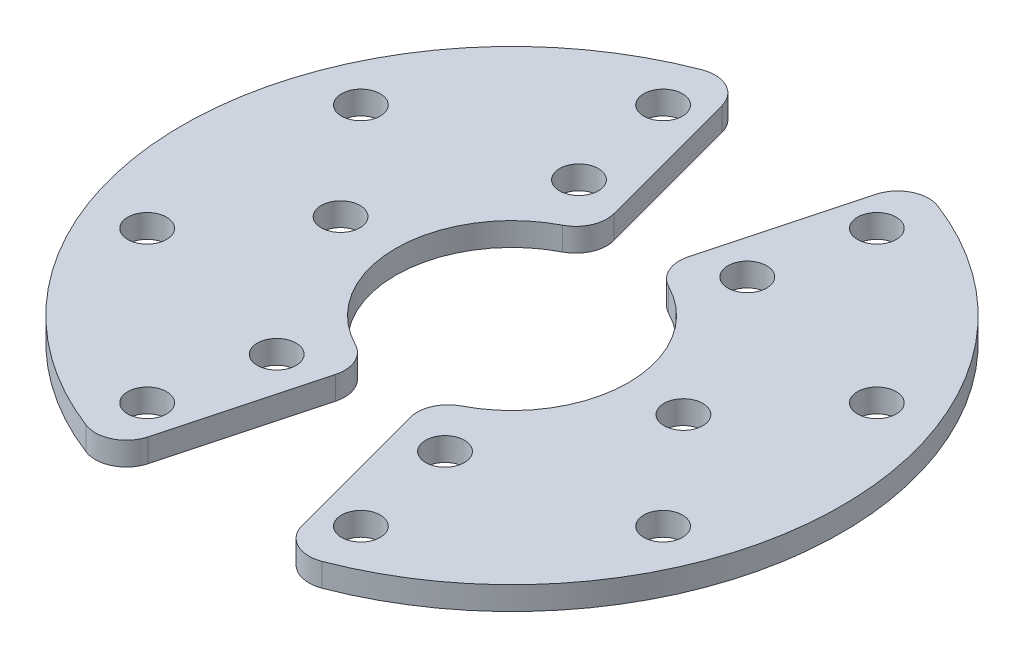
ISO-10303-21;
HEADER;
FILE_DESCRIPTION(('STEP AP214'),'2;1');
FILE_NAME('part.step','',(''),(''),'','','');
FILE_SCHEMA(('AUTOMOTIVE_DESIGN { 1 0 10303 214 1 1 1 1 }'));
ENDSEC;
DATA;
#1=APPLICATION_CONTEXT('core data for automotive mechanical design processes');
#2=APPLICATION_PROTOCOL_DEFINITION('international standard','automotive_design',2000,#1);
#3=PRODUCT_CONTEXT('',#1,'mechanical');
#4=PRODUCT('Part','Part','',(#3));
#5=PRODUCT_RELATED_PRODUCT_CATEGORY('part','',(#4));
#6=PRODUCT_DEFINITION_FORMATION('','',#4);
#7=PRODUCT_DEFINITION_CONTEXT('part definition',#1,'design');
#8=PRODUCT_DEFINITION('design','',#6,#7);
#9=PRODUCT_DEFINITION_SHAPE('','',#8);
#10=(LENGTH_UNIT() NAMED_UNIT(*) SI_UNIT(.MILLI.,.METRE.));
#11=(NAMED_UNIT(*) PLANE_ANGLE_UNIT() SI_UNIT($,.RADIAN.));
#12=(NAMED_UNIT(*) SI_UNIT($,.STERADIAN.) SOLID_ANGLE_UNIT());
#13=UNCERTAINTY_MEASURE_WITH_UNIT(LENGTH_MEASURE(1.E-05),#10,'distance_accuracy_value','');
#14=(GEOMETRIC_REPRESENTATION_CONTEXT(3) GLOBAL_UNCERTAINTY_ASSIGNED_CONTEXT((#13)) GLOBAL_UNIT_ASSIGNED_CONTEXT((#10,
#11,#12)) REPRESENTATION_CONTEXT('',''));
#15=CARTESIAN_POINT('',(0.,0.,0.));
#16=DIRECTION('',(0.,0.,1.));
#17=DIRECTION('',(1.,0.,0.));
#18=AXIS2_PLACEMENT_3D('',#15,#16,#17);
#19=CARTESIAN_POINT('',(0.,3.,0.));
#20=DIRECTION('',(0.,-1.,0.));
#21=DIRECTION('',(0.,0.,-1.));
#22=AXIS2_PLACEMENT_3D('',#19,#20,#21);
#23=CYLINDRICAL_SURFACE('',#22,15.);
#24=CARTESIAN_POINT('',(0.,3.,0.));
#25=DIRECTION('',(0.,1.,0.));
#26=DIRECTION('',(0.,0.,1.));
#27=AXIS2_PLACEMENT_3D('',#24,#25,#26);
#28=CIRCLE('',#27,15.);
#29=CARTESIAN_POINT('',(-6.84556871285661,3.,-13.3468419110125));
#30=VERTEX_POINT('',#29);
#31=CARTESIAN_POINT('',(-6.84556871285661,3.,13.3468419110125));
#32=VERTEX_POINT('',#31);
#33=EDGE_CURVE('E223',#30,#32,#28,.T.);
#34=ORIENTED_EDGE('',*,*,#33,.T.);
#35=DIRECTION('',(0.,-1.,0.));
#36=VECTOR('',#35,1.);
#37=CARTESIAN_POINT('',(-6.84556871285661,3.,13.3468419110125));
#38=LINE('',#37,#36);
#39=CARTESIAN_POINT('',(-6.84556871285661,0.,13.3468419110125));
#40=VERTEX_POINT('',#39);
#41=EDGE_CURVE('E165',#32,#40,#38,.T.);
#42=ORIENTED_EDGE('',*,*,#41,.T.);
#43=CARTESIAN_POINT('',(0.,0.,0.));
#44=DIRECTION('',(0.,1.,0.));
#45=DIRECTION('',(0.,0.,1.));
#46=AXIS2_PLACEMENT_3D('',#43,#44,#45);
#47=CIRCLE('',#46,15.);
#48=CARTESIAN_POINT('',(-6.84556871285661,0.,-13.3468419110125));
#49=VERTEX_POINT('',#48);
#50=EDGE_CURVE('E147',#49,#40,#47,.T.);
#51=ORIENTED_EDGE('',*,*,#50,.F.);
#52=DIRECTION('',(0.,-1.,0.));
#53=VECTOR('',#52,1.);
#54=CARTESIAN_POINT('',(-6.84556871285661,3.,-13.3468419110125));
#55=LINE('',#54,#53);
#56=EDGE_CURVE('E163',#49,#30,#55,.F.);
#57=ORIENTED_EDGE('',*,*,#56,.T.);
#58=EDGE_LOOP('',(#34,#42,#51,#57));
#59=FACE_BOUND('',#58,.T.);
#60=ADVANCED_FACE('F48',(#59),#23,.F.);
#61=CARTESIAN_POINT('',(0.,3.,0.));
#62=DIRECTION('',(0.,-1.,0.));
#63=DIRECTION('',(0.,0.,-1.));
#64=AXIS2_PLACEMENT_3D('',#61,#62,#63);
#65=CYLINDRICAL_SURFACE('',#64,42.5);
#66=CARTESIAN_POINT('',(0.,0.,0.));
#67=DIRECTION('',(0.,1.,0.));
#68=DIRECTION('',(0.,0.,1.));
#69=AXIS2_PLACEMENT_3D('',#66,#67,#68);
#70=CIRCLE('',#69,42.5);
#71=CARTESIAN_POINT('',(-15.2054071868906,0.,-39.6868440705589));
#72=VERTEX_POINT('',#71);
#73=CARTESIAN_POINT('',(-15.2054071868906,0.,39.6868440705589));
#74=VERTEX_POINT('',#73);
#75=EDGE_CURVE('E136',#72,#74,#70,.T.);
#76=ORIENTED_EDGE('',*,*,#75,.T.);
#77=DIRECTION('',(0.,-1.,0.));
#78=VECTOR('',#77,1.);
#79=CARTESIAN_POINT('',(-15.2054071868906,3.,39.6868440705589));
#80=LINE('',#79,#78);
#81=CARTESIAN_POINT('',(-15.2054071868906,3.,39.6868440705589));
#82=VERTEX_POINT('',#81);
#83=EDGE_CURVE('E134',#74,#82,#80,.F.);
#84=ORIENTED_EDGE('',*,*,#83,.T.);
#85=CARTESIAN_POINT('',(0.,3.,0.));
#86=DIRECTION('',(0.,1.,0.));
#87=DIRECTION('',(0.,0.,1.));
#88=AXIS2_PLACEMENT_3D('',#85,#86,#87);
#89=CIRCLE('',#88,42.5);
#90=CARTESIAN_POINT('',(-15.2054071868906,3.,-39.6868440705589));
#91=VERTEX_POINT('',#90);
#92=EDGE_CURVE('E118',#91,#82,#89,.T.);
#93=ORIENTED_EDGE('',*,*,#92,.F.);
#94=DIRECTION('',(0.,-1.,0.));
#95=VECTOR('',#94,1.);
#96=CARTESIAN_POINT('',(-15.2054071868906,3.,-39.6868440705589));
#97=LINE('',#96,#95);
#98=EDGE_CURVE('E131',#91,#72,#97,.T.);
#99=ORIENTED_EDGE('',*,*,#98,.T.);
#100=EDGE_LOOP('',(#76,#84,#93,#99));
#101=FACE_BOUND('',#100,.T.);
#102=ADVANCED_FACE('F130',(#101),#65,.T.);
#103=CARTESIAN_POINT('',(0.,3.,0.));
#104=DIRECTION('',(0.,1.,0.));
#105=DIRECTION('',(0.,0.,1.));
#106=AXIS2_PLACEMENT_3D('',#103,#104,#105);
#107=PLANE('',#106);
#108=CARTESIAN_POINT('',(-10.85,3.,19.4855715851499));
#109=DIRECTION('',(0.,1.,0.));
#110=DIRECTION('',(0.,0.,1.));
#111=AXIS2_PLACEMENT_3D('',#108,#109,#110);
#112=CIRCLE('',#111,2.5);
#113=CARTESIAN_POINT('',(-10.85,3.,21.9855715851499));
#114=VERTEX_POINT('',#113);
#115=EDGE_CURVE('E217',#114,#114,#112,.T.);
#116=ORIENTED_EDGE('',*,*,#115,.F.);
#117=EDGE_LOOP('',(#116));
#118=FACE_BOUND('',#117,.T.);
#119=CARTESIAN_POINT('',(-22.1,3.,0.));
#120=DIRECTION('',(0.,1.,0.));
#121=DIRECTION('',(0.,0.,1.));
#122=AXIS2_PLACEMENT_3D('',#119,#120,#121);
#123=CIRCLE('',#122,2.49999999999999);
#124=CARTESIAN_POINT('',(-22.1,3.,2.49999999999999));
#125=VERTEX_POINT('',#124);
#126=EDGE_CURVE('E214',#125,#125,#123,.T.);
#127=ORIENTED_EDGE('',*,*,#126,.F.);
#128=EDGE_LOOP('',(#127));
#129=FACE_BOUND('',#128,.T.);
#130=CARTESIAN_POINT('',(-10.85,3.,-19.4855715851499));
#131=DIRECTION('',(0.,1.,0.));
#132=DIRECTION('',(0.,0.,1.));
#133=AXIS2_PLACEMENT_3D('',#130,#131,#132);
#134=CIRCLE('',#133,2.50000000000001);
#135=CARTESIAN_POINT('',(-10.85,3.,-16.9855715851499));
#136=VERTEX_POINT('',#135);
#137=EDGE_CURVE('E211',#136,#136,#134,.T.);
#138=ORIENTED_EDGE('',*,*,#137,.F.);
#139=EDGE_LOOP('',(#138));
#140=FACE_BOUND('',#139,.T.);
#141=CARTESIAN_POINT('',(-13.776603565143,3.,-33.2596631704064));
#142=DIRECTION('',(0.,1.,0.));
#143=DIRECTION('',(0.,0.,1.));
#144=AXIS2_PLACEMENT_3D('',#141,#142,#143);
#145=CIRCLE('',#144,2.50000000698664);
#146=CARTESIAN_POINT('',(-13.776603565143,3.,-30.7596631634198));
#147=VERTEX_POINT('',#146);
#148=EDGE_CURVE('E208',#147,#147,#145,.T.);
#149=ORIENTED_EDGE('',*,*,#148,.F.);
#150=EDGE_LOOP('',(#149));
#151=FACE_BOUND('',#150,.T.);
#152=CARTESIAN_POINT('',(-33.2596631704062,3.,-13.7766035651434));
#153=DIRECTION('',(0.,1.,0.));
#154=DIRECTION('',(0.,0.,1.));
#155=AXIS2_PLACEMENT_3D('',#152,#153,#154);
#156=CIRCLE('',#155,2.5);
#157=CARTESIAN_POINT('',(-33.2596631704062,3.,-11.2766035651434));
#158=VERTEX_POINT('',#157);
#159=EDGE_CURVE('E205',#158,#158,#156,.T.);
#160=ORIENTED_EDGE('',*,*,#159,.F.);
#161=EDGE_LOOP('',(#160));
#162=FACE_BOUND('',#161,.T.);
#163=CARTESIAN_POINT('',(-33.2596631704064,3.,13.776603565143));
#164=DIRECTION('',(0.,1.,0.));
#165=DIRECTION('',(0.,0.,1.));
#166=AXIS2_PLACEMENT_3D('',#163,#164,#165);
#167=CIRCLE('',#166,2.5);
#168=CARTESIAN_POINT('',(-33.2596631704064,3.,16.276603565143));
#169=VERTEX_POINT('',#168);
#170=EDGE_CURVE('E202',#169,#169,#167,.T.);
#171=ORIENTED_EDGE('',*,*,#170,.F.);
#172=EDGE_LOOP('',(#171));
#173=FACE_BOUND('',#172,.T.);
#174=CARTESIAN_POINT('',(-13.7766035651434,3.,33.2596631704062));
#175=DIRECTION('',(0.,1.,0.));
#176=DIRECTION('',(0.,0.,1.));
#177=AXIS2_PLACEMENT_3D('',#174,#175,#176);
#178=CIRCLE('',#177,2.5);
#179=CARTESIAN_POINT('',(-13.7766035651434,3.,35.7596631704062));
#180=VERTEX_POINT('',#179);
#181=EDGE_CURVE('E178',#180,#180,#178,.T.);
#182=ORIENTED_EDGE('',*,*,#181,.F.);
#183=EDGE_LOOP('',(#182));
#184=FACE_BOUND('',#183,.T.);
#185=ORIENTED_EDGE('',*,*,#92,.T.);
#186=CARTESIAN_POINT('',(-13.7743100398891,3.,35.9516116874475));
#187=DIRECTION('',(0.,1.,0.));
#188=DIRECTION('',(0.,0.,1.));
#189=AXIS2_PLACEMENT_3D('',#186,#187,#188);
#190=CIRCLE('',#189,4.);
#191=CARTESIAN_POINT('',(-9.91060673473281,3.,36.9868878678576));
#192=VERTEX_POINT('',#191);
#193=EDGE_CURVE('E152',#82,#192,#190,.T.);
#194=ORIENTED_EDGE('',*,*,#193,.T.);
#195=DIRECTION('',(0.258819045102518,0.,-0.965925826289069));
#196=VECTOR('',#195,1.);
#197=CARTESIAN_POINT('',(0.,3.,0.));
#198=LINE('',#197,#196);
#199=CARTESIAN_POINT('',(-4.80735039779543,3.,17.9412759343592));
#200=VERTEX_POINT('',#199);
#201=EDGE_CURVE('E135',#192,#200,#198,.T.);
#202=ORIENTED_EDGE('',*,*,#201,.T.);
#203=CARTESIAN_POINT('',(-8.6710537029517,3.,16.9059997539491));
#204=DIRECTION('',(0.,1.,0.));
#205=DIRECTION('',(0.,0.,1.));
#206=AXIS2_PLACEMENT_3D('',#203,#204,#205);
#207=CIRCLE('',#206,4.);
#208=EDGE_CURVE('E124',#200,#32,#207,.T.);
#209=ORIENTED_EDGE('',*,*,#208,.T.);
#210=ORIENTED_EDGE('',*,*,#33,.F.);
#211=CARTESIAN_POINT('',(-8.6710537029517,3.,-16.9059997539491));
#212=DIRECTION('',(0.,1.,0.));
#213=DIRECTION('',(0.,0.,1.));
#214=AXIS2_PLACEMENT_3D('',#211,#212,#213);
#215=CIRCLE('',#214,4.);
#216=CARTESIAN_POINT('',(-4.80735039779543,3.,-17.9412759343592));
#217=VERTEX_POINT('',#216);
#218=EDGE_CURVE('E125',#30,#217,#215,.T.);
#219=ORIENTED_EDGE('',*,*,#218,.T.);
#220=DIRECTION('',(0.258819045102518,0.,0.965925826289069));
#221=VECTOR('',#220,1.);
#222=CARTESIAN_POINT('',(0.,3.,0.));
#223=LINE('',#222,#221);
#224=CARTESIAN_POINT('',(-9.91060673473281,3.,-36.9868878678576));
#225=VERTEX_POINT('',#224);
#226=EDGE_CURVE('E120',#225,#217,#223,.T.);
#227=ORIENTED_EDGE('',*,*,#226,.F.);
#228=CARTESIAN_POINT('',(-13.7743100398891,3.,-35.9516116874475));
#229=DIRECTION('',(0.,1.,0.));
#230=DIRECTION('',(0.,0.,1.));
#231=AXIS2_PLACEMENT_3D('',#228,#229,#230);
#232=CIRCLE('',#231,4.);
#233=EDGE_CURVE('E115',#225,#91,#232,.T.);
#234=ORIENTED_EDGE('',*,*,#233,.T.);
#235=EDGE_LOOP('',(#185,#194,#202,#209,#210,#219,#227,#234));
#236=FACE_BOUND('',#235,.T.);
#237=ADVANCED_FACE('F117',(#118,#129,#140,#151,#162,#173,#184,#236),#107,.T.);
#238=CARTESIAN_POINT('',(0.,0.,0.));
#239=DIRECTION('',(0.,1.,0.));
#240=DIRECTION('',(0.,0.,1.));
#241=AXIS2_PLACEMENT_3D('',#238,#239,#240);
#242=PLANE('',#241);
#243=CARTESIAN_POINT('',(-13.7766035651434,0.,33.2596631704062));
#244=DIRECTION('',(0.,1.,0.));
#245=DIRECTION('',(0.,0.,1.));
#246=AXIS2_PLACEMENT_3D('',#243,#244,#245);
#247=CIRCLE('',#246,2.5);
#248=CARTESIAN_POINT('',(-13.7766035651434,0.,35.7596631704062));
#249=VERTEX_POINT('',#248);
#250=EDGE_CURVE('E183',#249,#249,#247,.T.);
#251=ORIENTED_EDGE('',*,*,#250,.T.);
#252=EDGE_LOOP('',(#251));
#253=FACE_BOUND('',#252,.T.);
#254=CARTESIAN_POINT('',(-33.2596631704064,0.,13.776603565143));
#255=DIRECTION('',(0.,1.,0.));
#256=DIRECTION('',(0.,0.,1.));
#257=AXIS2_PLACEMENT_3D('',#254,#255,#256);
#258=CIRCLE('',#257,2.5);
#259=CARTESIAN_POINT('',(-33.2596631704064,0.,16.276603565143));
#260=VERTEX_POINT('',#259);
#261=EDGE_CURVE('E186',#260,#260,#258,.T.);
#262=ORIENTED_EDGE('',*,*,#261,.T.);
#263=EDGE_LOOP('',(#262));
#264=FACE_BOUND('',#263,.T.);
#265=CARTESIAN_POINT('',(-33.2596631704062,0.,-13.7766035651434));
#266=DIRECTION('',(0.,1.,0.));
#267=DIRECTION('',(0.,0.,1.));
#268=AXIS2_PLACEMENT_3D('',#265,#266,#267);
#269=CIRCLE('',#268,2.5);
#270=CARTESIAN_POINT('',(-33.2596631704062,0.,-11.2766035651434));
#271=VERTEX_POINT('',#270);
#272=EDGE_CURVE('E189',#271,#271,#269,.T.);
#273=ORIENTED_EDGE('',*,*,#272,.T.);
#274=EDGE_LOOP('',(#273));
#275=FACE_BOUND('',#274,.T.);
#276=CARTESIAN_POINT('',(-13.776603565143,0.,-33.2596631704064));
#277=DIRECTION('',(0.,1.,0.));
#278=DIRECTION('',(0.,0.,1.));
#279=AXIS2_PLACEMENT_3D('',#276,#277,#278);
#280=CIRCLE('',#279,2.50000000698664);
#281=CARTESIAN_POINT('',(-13.776603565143,0.,-30.7596631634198));
#282=VERTEX_POINT('',#281);
#283=EDGE_CURVE('E192',#282,#282,#280,.T.);
#284=ORIENTED_EDGE('',*,*,#283,.T.);
#285=EDGE_LOOP('',(#284));
#286=FACE_BOUND('',#285,.T.);
#287=CARTESIAN_POINT('',(-10.85,0.,-19.4855715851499));
#288=DIRECTION('',(0.,1.,0.));
#289=DIRECTION('',(0.,0.,1.));
#290=AXIS2_PLACEMENT_3D('',#287,#288,#289);
#291=CIRCLE('',#290,2.50000000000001);
#292=CARTESIAN_POINT('',(-10.85,0.,-16.9855715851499));
#293=VERTEX_POINT('',#292);
#294=EDGE_CURVE('E195',#293,#293,#291,.T.);
#295=ORIENTED_EDGE('',*,*,#294,.T.);
#296=EDGE_LOOP('',(#295));
#297=FACE_BOUND('',#296,.T.);
#298=CARTESIAN_POINT('',(-22.1,0.,0.));
#299=DIRECTION('',(0.,1.,0.));
#300=DIRECTION('',(0.,0.,1.));
#301=AXIS2_PLACEMENT_3D('',#298,#299,#300);
#302=CIRCLE('',#301,2.49999999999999);
#303=CARTESIAN_POINT('',(-22.1,0.,2.49999999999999));
#304=VERTEX_POINT('',#303);
#305=EDGE_CURVE('E180',#304,#304,#302,.T.);
#306=ORIENTED_EDGE('',*,*,#305,.T.);
#307=EDGE_LOOP('',(#306));
#308=FACE_BOUND('',#307,.T.);
#309=CARTESIAN_POINT('',(-10.85,0.,19.4855715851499));
#310=DIRECTION('',(0.,1.,0.));
#311=DIRECTION('',(0.,0.,1.));
#312=AXIS2_PLACEMENT_3D('',#309,#310,#311);
#313=CIRCLE('',#312,2.5);
#314=CARTESIAN_POINT('',(-10.85,0.,21.9855715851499));
#315=VERTEX_POINT('',#314);
#316=EDGE_CURVE('E176',#315,#315,#313,.T.);
#317=ORIENTED_EDGE('',*,*,#316,.T.);
#318=EDGE_LOOP('',(#317));
#319=FACE_BOUND('',#318,.T.);
#320=DIRECTION('',(0.258819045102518,0.,-0.965925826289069));
#321=VECTOR('',#320,1.);
#322=CARTESIAN_POINT('',(0.,0.,0.));
#323=LINE('',#322,#321);
#324=CARTESIAN_POINT('',(-9.91060673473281,0.,36.9868878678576));
#325=VERTEX_POINT('',#324);
#326=CARTESIAN_POINT('',(-4.80735039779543,0.,17.9412759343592));
#327=VERTEX_POINT('',#326);
#328=EDGE_CURVE('E141',#325,#327,#323,.T.);
#329=ORIENTED_EDGE('',*,*,#328,.F.);
#330=CARTESIAN_POINT('',(-13.7743100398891,0.,35.9516116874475));
#331=DIRECTION('',(0.,1.,0.));
#332=DIRECTION('',(0.,0.,1.));
#333=AXIS2_PLACEMENT_3D('',#330,#331,#332);
#334=CIRCLE('',#333,4.);
#335=EDGE_CURVE('E161',#325,#74,#334,.F.);
#336=ORIENTED_EDGE('',*,*,#335,.T.);
#337=ORIENTED_EDGE('',*,*,#75,.F.);
#338=CARTESIAN_POINT('',(-13.7743100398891,0.,-35.9516116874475));
#339=DIRECTION('',(0.,1.,0.));
#340=DIRECTION('',(0.,0.,1.));
#341=AXIS2_PLACEMENT_3D('',#338,#339,#340);
#342=CIRCLE('',#341,4.);
#343=CARTESIAN_POINT('',(-9.91060673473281,0.,-36.9868878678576));
#344=VERTEX_POINT('',#343);
#345=EDGE_CURVE('E140',#72,#344,#342,.F.);
#346=ORIENTED_EDGE('',*,*,#345,.T.);
#347=DIRECTION('',(0.258819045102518,0.,0.965925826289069));
#348=VECTOR('',#347,1.);
#349=CARTESIAN_POINT('',(0.,0.,0.));
#350=LINE('',#349,#348);
#351=CARTESIAN_POINT('',(-4.80735039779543,0.,-17.9412759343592));
#352=VERTEX_POINT('',#351);
#353=EDGE_CURVE('E171',#344,#352,#350,.T.);
#354=ORIENTED_EDGE('',*,*,#353,.T.);
#355=CARTESIAN_POINT('',(-8.6710537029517,0.,-16.9059997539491));
#356=DIRECTION('',(0.,1.,0.));
#357=DIRECTION('',(0.,0.,1.));
#358=AXIS2_PLACEMENT_3D('',#355,#356,#357);
#359=CIRCLE('',#358,4.);
#360=EDGE_CURVE('E71',#352,#49,#359,.F.);
#361=ORIENTED_EDGE('',*,*,#360,.T.);
#362=ORIENTED_EDGE('',*,*,#50,.T.);
#363=CARTESIAN_POINT('',(-8.6710537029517,0.,16.9059997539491));
#364=DIRECTION('',(0.,1.,0.));
#365=DIRECTION('',(0.,0.,1.));
#366=AXIS2_PLACEMENT_3D('',#363,#364,#365);
#367=CIRCLE('',#366,4.);
#368=EDGE_CURVE('E63',#40,#327,#367,.F.);
#369=ORIENTED_EDGE('',*,*,#368,.T.);
#370=EDGE_LOOP('',(#329,#336,#337,#346,#354,#361,#362,#369));
#371=FACE_BOUND('',#370,.T.);
#372=ADVANCED_FACE('F175',(#253,#264,#275,#286,#297,#308,#319,#371),#242,.F.);
#373=CARTESIAN_POINT('',(-13.7766035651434,3.,33.2596631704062));
#374=DIRECTION('',(0.,-1.,0.));
#375=DIRECTION('',(0.,0.,-1.));
#376=AXIS2_PLACEMENT_3D('',#373,#374,#375);
#377=CYLINDRICAL_SURFACE('',#376,2.5);
#378=ORIENTED_EDGE('',*,*,#181,.T.);
#379=EDGE_LOOP('',(#378));
#380=FACE_BOUND('',#379,.T.);
#381=ORIENTED_EDGE('',*,*,#250,.F.);
#382=EDGE_LOOP('',(#381));
#383=FACE_BOUND('',#382,.T.);
#384=ADVANCED_FACE('F353',(#380,#383),#377,.F.);
#385=CARTESIAN_POINT('',(-33.2596631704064,3.,13.776603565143));
#386=DIRECTION('',(0.,-1.,0.));
#387=DIRECTION('',(0.,0.,-1.));
#388=AXIS2_PLACEMENT_3D('',#385,#386,#387);
#389=CYLINDRICAL_SURFACE('',#388,2.5);
#390=ORIENTED_EDGE('',*,*,#170,.T.);
#391=EDGE_LOOP('',(#390));
#392=FACE_BOUND('',#391,.T.);
#393=ORIENTED_EDGE('',*,*,#261,.F.);
#394=EDGE_LOOP('',(#393));
#395=FACE_BOUND('',#394,.T.);
#396=ADVANCED_FACE('F343',(#392,#395),#389,.F.);
#397=CARTESIAN_POINT('',(-33.2596631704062,3.,-13.7766035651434));
#398=DIRECTION('',(0.,-1.,0.));
#399=DIRECTION('',(0.,0.,-1.));
#400=AXIS2_PLACEMENT_3D('',#397,#398,#399);
#401=CYLINDRICAL_SURFACE('',#400,2.5);
#402=ORIENTED_EDGE('',*,*,#159,.T.);
#403=EDGE_LOOP('',(#402));
#404=FACE_BOUND('',#403,.T.);
#405=ORIENTED_EDGE('',*,*,#272,.F.);
#406=EDGE_LOOP('',(#405));
#407=FACE_BOUND('',#406,.T.);
#408=ADVANCED_FACE('F333',(#404,#407),#401,.F.);
#409=CARTESIAN_POINT('',(-13.776603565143,3.,-33.2596631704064));
#410=DIRECTION('',(0.,-1.,0.));
#411=DIRECTION('',(0.,0.,-1.));
#412=AXIS2_PLACEMENT_3D('',#409,#410,#411);
#413=CYLINDRICAL_SURFACE('',#412,2.50000000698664);
#414=ORIENTED_EDGE('',*,*,#148,.T.);
#415=EDGE_LOOP('',(#414));
#416=FACE_BOUND('',#415,.T.);
#417=ORIENTED_EDGE('',*,*,#283,.F.);
#418=EDGE_LOOP('',(#417));
#419=FACE_BOUND('',#418,.T.);
#420=ADVANCED_FACE('F323',(#416,#419),#413,.F.);
#421=CARTESIAN_POINT('',(-10.85,3.,-19.4855715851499));
#422=DIRECTION('',(0.,-1.,0.));
#423=DIRECTION('',(0.,0.,-1.));
#424=AXIS2_PLACEMENT_3D('',#421,#422,#423);
#425=CYLINDRICAL_SURFACE('',#424,2.50000000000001);
#426=ORIENTED_EDGE('',*,*,#137,.T.);
#427=EDGE_LOOP('',(#426));
#428=FACE_BOUND('',#427,.T.);
#429=ORIENTED_EDGE('',*,*,#294,.F.);
#430=EDGE_LOOP('',(#429));
#431=FACE_BOUND('',#430,.T.);
#432=ADVANCED_FACE('F313',(#428,#431),#425,.F.);
#433=CARTESIAN_POINT('',(-22.1,3.,0.));
#434=DIRECTION('',(0.,-1.,0.));
#435=DIRECTION('',(0.,0.,-1.));
#436=AXIS2_PLACEMENT_3D('',#433,#434,#435);
#437=CYLINDRICAL_SURFACE('',#436,2.49999999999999);
#438=ORIENTED_EDGE('',*,*,#126,.T.);
#439=EDGE_LOOP('',(#438));
#440=FACE_BOUND('',#439,.T.);
#441=ORIENTED_EDGE('',*,*,#305,.F.);
#442=EDGE_LOOP('',(#441));
#443=FACE_BOUND('',#442,.T.);
#444=ADVANCED_FACE('F303',(#440,#443),#437,.F.);
#445=CARTESIAN_POINT('',(-10.85,3.,19.4855715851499));
#446=DIRECTION('',(0.,-1.,0.));
#447=DIRECTION('',(0.,0.,-1.));
#448=AXIS2_PLACEMENT_3D('',#445,#446,#447);
#449=CYLINDRICAL_SURFACE('',#448,2.5);
#450=ORIENTED_EDGE('',*,*,#115,.T.);
#451=EDGE_LOOP('',(#450));
#452=FACE_BOUND('',#451,.T.);
#453=ORIENTED_EDGE('',*,*,#316,.F.);
#454=EDGE_LOOP('',(#453));
#455=FACE_BOUND('',#454,.T.);
#456=ADVANCED_FACE('F294',(#452,#455),#449,.F.);
#457=CARTESIAN_POINT('',(0.,-7.,0.));
#458=DIRECTION('',(-0.965925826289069,0.,0.258819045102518));
#459=DIRECTION('',(0.258819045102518,0.,0.965925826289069));
#460=AXIS2_PLACEMENT_3D('',#457,#458,#459);
#461=PLANE('',#460);
#462=ORIENTED_EDGE('',*,*,#353,.F.);
#463=DIRECTION('',(0.,-1.,0.));
#464=VECTOR('',#463,1.);
#465=CARTESIAN_POINT('',(-9.91060673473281,-7.,-36.9868878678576));
#466=LINE('',#465,#464);
#467=EDGE_CURVE('E12',#344,#225,#466,.F.);
#468=ORIENTED_EDGE('',*,*,#467,.T.);
#469=ORIENTED_EDGE('',*,*,#226,.T.);
#470=DIRECTION('',(0.,1.,0.));
#471=VECTOR('',#470,1.);
#472=CARTESIAN_POINT('',(-4.80735039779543,0.,-17.9412759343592));
#473=LINE('',#472,#471);
#474=EDGE_CURVE('E56',#217,#352,#473,.F.);
#475=ORIENTED_EDGE('',*,*,#474,.T.);
#476=EDGE_LOOP('',(#462,#468,#469,#475));
#477=FACE_BOUND('',#476,.T.);
#478=ADVANCED_FACE('F170',(#477),#461,.F.);
#479=CARTESIAN_POINT('',(0.,-7.,0.));
#480=DIRECTION('',(0.965925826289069,0.,0.258819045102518));
#481=DIRECTION('',(0.258819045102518,0.,-0.965925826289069));
#482=AXIS2_PLACEMENT_3D('',#479,#480,#481);
#483=PLANE('',#482);
#484=ORIENTED_EDGE('',*,*,#201,.F.);
#485=DIRECTION('',(0.,1.,0.));
#486=VECTOR('',#485,1.);
#487=CARTESIAN_POINT('',(-9.91060673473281,0.,36.9868878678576));
#488=LINE('',#487,#486);
#489=EDGE_CURVE('E156',#192,#325,#488,.F.);
#490=ORIENTED_EDGE('',*,*,#489,.T.);
#491=ORIENTED_EDGE('',*,*,#328,.T.);
#492=DIRECTION('',(0.,-1.,0.));
#493=VECTOR('',#492,1.);
#494=CARTESIAN_POINT('',(-4.80735039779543,-7.,17.9412759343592));
#495=LINE('',#494,#493);
#496=EDGE_CURVE('E154',#327,#200,#495,.F.);
#497=ORIENTED_EDGE('',*,*,#496,.T.);
#498=EDGE_LOOP('',(#484,#490,#491,#497));
#499=FACE_BOUND('',#498,.T.);
#500=ADVANCED_FACE('F232',(#499),#483,.T.);
#501=CARTESIAN_POINT('',(-13.7743100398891,3.,35.9516116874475));
#502=DIRECTION('',(0.,-1.,0.));
#503=DIRECTION('',(0.,0.,-1.));
#504=AXIS2_PLACEMENT_3D('',#501,#502,#503);
#505=CYLINDRICAL_SURFACE('',#504,4.);
#506=ORIENTED_EDGE('',*,*,#335,.F.);
#507=ORIENTED_EDGE('',*,*,#489,.F.);
#508=ORIENTED_EDGE('',*,*,#193,.F.);
#509=ORIENTED_EDGE('',*,*,#83,.F.);
#510=EDGE_LOOP('',(#506,#507,#508,#509));
#511=FACE_BOUND('',#510,.T.);
#512=ADVANCED_FACE('F227',(#511),#505,.T.);
#513=CARTESIAN_POINT('',(-8.6710537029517,3.,16.9059997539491));
#514=DIRECTION('',(0.,-1.,0.));
#515=DIRECTION('',(0.,0.,-1.));
#516=AXIS2_PLACEMENT_3D('',#513,#514,#515);
#517=CYLINDRICAL_SURFACE('',#516,4.);
#518=ORIENTED_EDGE('',*,*,#208,.F.);
#519=ORIENTED_EDGE('',*,*,#496,.F.);
#520=ORIENTED_EDGE('',*,*,#368,.F.);
#521=ORIENTED_EDGE('',*,*,#41,.F.);
#522=EDGE_LOOP('',(#518,#519,#520,#521));
#523=FACE_BOUND('',#522,.T.);
#524=ADVANCED_FACE('F233',(#523),#517,.T.);
#525=CARTESIAN_POINT('',(-13.7743100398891,3.,-35.9516116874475));
#526=DIRECTION('',(0.,-1.,0.));
#527=DIRECTION('',(0.,0.,-1.));
#528=AXIS2_PLACEMENT_3D('',#525,#526,#527);
#529=CYLINDRICAL_SURFACE('',#528,4.);
#530=ORIENTED_EDGE('',*,*,#345,.F.);
#531=ORIENTED_EDGE('',*,*,#98,.F.);
#532=ORIENTED_EDGE('',*,*,#233,.F.);
#533=ORIENTED_EDGE('',*,*,#467,.F.);
#534=EDGE_LOOP('',(#530,#531,#532,#533));
#535=FACE_BOUND('',#534,.T.);
#536=ADVANCED_FACE('F139',(#535),#529,.T.);
#537=CARTESIAN_POINT('',(-8.6710537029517,3.,-16.9059997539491));
#538=DIRECTION('',(0.,-1.,0.));
#539=DIRECTION('',(0.,0.,-1.));
#540=AXIS2_PLACEMENT_3D('',#537,#538,#539);
#541=CYLINDRICAL_SURFACE('',#540,4.);
#542=ORIENTED_EDGE('',*,*,#218,.F.);
#543=ORIENTED_EDGE('',*,*,#56,.F.);
#544=ORIENTED_EDGE('',*,*,#360,.F.);
#545=ORIENTED_EDGE('',*,*,#474,.F.);
#546=EDGE_LOOP('',(#542,#543,#544,#545));
#547=FACE_BOUND('',#546,.T.);
#548=ADVANCED_FACE('F50',(#547),#541,.T.);
#549=CLOSED_SHELL('',(#60,#102,#237,#372,#384,#396,#408,#420,#432,#444,#456,#478,#500,#512,#524,
#536,#548));
#550=MANIFOLD_SOLID_BREP('B2',#549);
#551=CARTESIAN_POINT('',(0.,-7.,0.));
#552=DIRECTION('',(0.965925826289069,0.,0.258819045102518));
#553=DIRECTION('',(0.258819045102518,0.,-0.965925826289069));
#554=AXIS2_PLACEMENT_3D('',#551,#552,#553);
#555=PLANE('',#554);
#556=DIRECTION('',(0.258819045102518,0.,-0.965925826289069));
#557=VECTOR('',#556,1.);
#558=CARTESIAN_POINT('',(0.,0.,0.));
#559=LINE('',#558,#557);
#560=CARTESIAN_POINT('',(4.80735039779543,0.,-17.9412759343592));
#561=VERTEX_POINT('',#560);
#562=CARTESIAN_POINT('',(9.91060673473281,0.,-36.9868878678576));
#563=VERTEX_POINT('',#562);
#564=EDGE_CURVE('E620',#561,#563,#559,.T.);
#565=ORIENTED_EDGE('',*,*,#564,.F.);
#566=DIRECTION('',(0.,1.,0.));
#567=VECTOR('',#566,1.);
#568=CARTESIAN_POINT('',(4.80735039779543,3.,-17.9412759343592));
#569=LINE('',#568,#567);
#570=CARTESIAN_POINT('',(4.80735039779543,3.,-17.9412759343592));
#571=VERTEX_POINT('',#570);
#572=EDGE_CURVE('E46',#561,#571,#569,.T.);
#573=ORIENTED_EDGE('',*,*,#572,.T.);
#574=DIRECTION('',(0.258819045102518,0.,-0.965925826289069));
#575=VECTOR('',#574,1.);
#576=CARTESIAN_POINT('',(0.,3.,0.));
#577=LINE('',#576,#575);
#578=CARTESIAN_POINT('',(9.91060673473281,3.,-36.9868878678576));
#579=VERTEX_POINT('',#578);
#580=EDGE_CURVE('E623',#571,#579,#577,.T.);
#581=ORIENTED_EDGE('',*,*,#580,.T.);
#582=DIRECTION('',(0.,-1.,0.));
#583=VECTOR('',#582,1.);
#584=CARTESIAN_POINT('',(9.91060673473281,-7.,-36.9868878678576));
#585=LINE('',#584,#583);
#586=EDGE_CURVE('E509',#579,#563,#585,.T.);
#587=ORIENTED_EDGE('',*,*,#586,.T.);
#588=EDGE_LOOP('',(#565,#573,#581,#587));
#589=FACE_BOUND('',#588,.T.);
#590=ADVANCED_FACE('F501',(#589),#555,.F.);
#591=CARTESIAN_POINT('',(10.85,3.,19.4855715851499));
#592=DIRECTION('',(0.,-1.,0.));
#593=DIRECTION('',(0.,0.,-1.));
#594=AXIS2_PLACEMENT_3D('',#591,#592,#593);
#595=CYLINDRICAL_SURFACE('',#594,2.5);
#596=CARTESIAN_POINT('',(10.85,3.,19.4855715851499));
#597=DIRECTION('',(0.,1.,0.));
#598=DIRECTION('',(0.,0.,1.));
#599=AXIS2_PLACEMENT_3D('',#596,#597,#598);
#600=CIRCLE('',#599,2.5);
#601=CARTESIAN_POINT('',(10.85,3.,21.9855715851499));
#602=VERTEX_POINT('',#601);
#603=EDGE_CURVE('E659',#602,#602,#600,.F.);
#604=ORIENTED_EDGE('',*,*,#603,.F.);
#605=EDGE_LOOP('',(#604));
#606=FACE_BOUND('',#605,.T.);
#607=CARTESIAN_POINT('',(10.85,0.,19.4855715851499));
#608=DIRECTION('',(0.,1.,0.));
#609=DIRECTION('',(0.,0.,1.));
#610=AXIS2_PLACEMENT_3D('',#607,#608,#609);
#611=CIRCLE('',#610,2.5);
#612=CARTESIAN_POINT('',(10.85,0.,21.9855715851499));
#613=VERTEX_POINT('',#612);
#614=EDGE_CURVE('E639',#613,#613,#611,.F.);
#615=ORIENTED_EDGE('',*,*,#614,.T.);
#616=EDGE_LOOP('',(#615));
#617=FACE_BOUND('',#616,.T.);
#618=ADVANCED_FACE('F677',(#606,#617),#595,.F.);
#619=CARTESIAN_POINT('',(22.1,3.,0.));
#620=DIRECTION('',(0.,-1.,0.));
#621=DIRECTION('',(0.,0.,-1.));
#622=AXIS2_PLACEMENT_3D('',#619,#620,#621);
#623=CYLINDRICAL_SURFACE('',#622,2.49999999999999);
#624=CARTESIAN_POINT('',(22.1,3.,0.));
#625=DIRECTION('',(0.,1.,0.));
#626=DIRECTION('',(0.,0.,1.));
#627=AXIS2_PLACEMENT_3D('',#624,#625,#626);
#628=CIRCLE('',#627,2.49999999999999);
#629=CARTESIAN_POINT('',(22.1,3.,2.49999999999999));
#630=VERTEX_POINT('',#629);
#631=EDGE_CURVE('E724',#630,#630,#628,.F.);
#632=ORIENTED_EDGE('',*,*,#631,.F.);
#633=EDGE_LOOP('',(#632));
#634=FACE_BOUND('',#633,.T.);
#635=CARTESIAN_POINT('',(22.1,0.,0.));
#636=DIRECTION('',(0.,1.,0.));
#637=DIRECTION('',(0.,0.,1.));
#638=AXIS2_PLACEMENT_3D('',#635,#636,#637);
#639=CIRCLE('',#638,2.49999999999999);
#640=CARTESIAN_POINT('',(22.1,0.,2.49999999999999));
#641=VERTEX_POINT('',#640);
#642=EDGE_CURVE('E642',#641,#641,#639,.F.);
#643=ORIENTED_EDGE('',*,*,#642,.T.);
#644=EDGE_LOOP('',(#643));
#645=FACE_BOUND('',#644,.T.);
#646=ADVANCED_FACE('F682',(#634,#645),#623,.F.);
#647=CARTESIAN_POINT('',(10.85,3.,-19.4855715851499));
#648=DIRECTION('',(0.,-1.,0.));
#649=DIRECTION('',(0.,0.,-1.));
#650=AXIS2_PLACEMENT_3D('',#647,#648,#649);
#651=CYLINDRICAL_SURFACE('',#650,2.50000000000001);
#652=CARTESIAN_POINT('',(10.85,3.,-19.4855715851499));
#653=DIRECTION('',(0.,1.,0.));
#654=DIRECTION('',(0.,0.,1.));
#655=AXIS2_PLACEMENT_3D('',#652,#653,#654);
#656=CIRCLE('',#655,2.50000000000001);
#657=CARTESIAN_POINT('',(10.85,3.,-16.9855715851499));
#658=VERTEX_POINT('',#657);
#659=EDGE_CURVE('E731',#658,#658,#656,.F.);
#660=ORIENTED_EDGE('',*,*,#659,.F.);
#661=EDGE_LOOP('',(#660));
#662=FACE_BOUND('',#661,.T.);
#663=CARTESIAN_POINT('',(10.85,0.,-19.4855715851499));
#664=DIRECTION('',(0.,1.,0.));
#665=DIRECTION('',(0.,0.,1.));
#666=AXIS2_PLACEMENT_3D('',#663,#664,#665);
#667=CIRCLE('',#666,2.50000000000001);
#668=CARTESIAN_POINT('',(10.85,0.,-16.9855715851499));
#669=VERTEX_POINT('',#668);
#670=EDGE_CURVE('E645',#669,#669,#667,.F.);
#671=ORIENTED_EDGE('',*,*,#670,.T.);
#672=EDGE_LOOP('',(#671));
#673=FACE_BOUND('',#672,.T.);
#674=ADVANCED_FACE('F712',(#662,#673),#651,.F.);
#675=CARTESIAN_POINT('',(33.2596631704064,3.,-13.776603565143));
#676=DIRECTION('',(0.,-1.,0.));
#677=DIRECTION('',(0.,0.,-1.));
#678=AXIS2_PLACEMENT_3D('',#675,#676,#677);
#679=CYLINDRICAL_SURFACE('',#678,2.49999999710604);
#680=CARTESIAN_POINT('',(33.2596631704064,3.,-13.776603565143));
#681=DIRECTION('',(0.,1.,0.));
#682=DIRECTION('',(0.,0.,1.));
#683=AXIS2_PLACEMENT_3D('',#680,#681,#682);
#684=CIRCLE('',#683,2.49999999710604);
#685=CARTESIAN_POINT('',(33.2596631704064,3.,-11.276603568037));
#686=VERTEX_POINT('',#685);
#687=EDGE_CURVE('E734',#686,#686,#684,.T.);
#688=ORIENTED_EDGE('',*,*,#687,.T.);
#689=EDGE_LOOP('',(#688));
#690=FACE_BOUND('',#689,.T.);
#691=CARTESIAN_POINT('',(33.2596631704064,0.,-13.776603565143));
#692=DIRECTION('',(0.,1.,0.));
#693=DIRECTION('',(0.,0.,1.));
#694=AXIS2_PLACEMENT_3D('',#691,#692,#693);
#695=CIRCLE('',#694,2.49999999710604);
#696=CARTESIAN_POINT('',(33.2596631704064,0.,-11.276603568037));
#697=VERTEX_POINT('',#696);
#698=EDGE_CURVE('E648',#697,#697,#695,.T.);
#699=ORIENTED_EDGE('',*,*,#698,.F.);
#700=EDGE_LOOP('',(#699));
#701=FACE_BOUND('',#700,.T.);
#702=ADVANCED_FACE('F708',(#690,#701),#679,.F.);
#703=CARTESIAN_POINT('',(13.7766035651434,3.,-33.2596631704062));
#704=DIRECTION('',(0.,-1.,0.));
#705=DIRECTION('',(0.,0.,-1.));
#706=AXIS2_PLACEMENT_3D('',#703,#704,#705);
#707=CYLINDRICAL_SURFACE('',#706,2.5);
#708=CARTESIAN_POINT('',(13.7766035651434,3.,-33.2596631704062));
#709=DIRECTION('',(0.,1.,0.));
#710=DIRECTION('',(0.,0.,1.));
#711=AXIS2_PLACEMENT_3D('',#708,#709,#710);
#712=CIRCLE('',#711,2.5);
#713=CARTESIAN_POINT('',(13.7766035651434,3.,-30.7596631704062));
#714=VERTEX_POINT('',#713);
#715=EDGE_CURVE('E742',#714,#714,#712,.T.);
#716=ORIENTED_EDGE('',*,*,#715,.T.);
#717=EDGE_LOOP('',(#716));
#718=FACE_BOUND('',#717,.T.);
#719=CARTESIAN_POINT('',(13.7766035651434,0.,-33.2596631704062));
#720=DIRECTION('',(0.,1.,0.));
#721=DIRECTION('',(0.,0.,1.));
#722=AXIS2_PLACEMENT_3D('',#719,#720,#721);
#723=CIRCLE('',#722,2.5);
#724=CARTESIAN_POINT('',(13.7766035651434,0.,-30.7596631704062));
#725=VERTEX_POINT('',#724);
#726=EDGE_CURVE('E651',#725,#725,#723,.T.);
#727=ORIENTED_EDGE('',*,*,#726,.F.);
#728=EDGE_LOOP('',(#727));
#729=FACE_BOUND('',#728,.T.);
#730=ADVANCED_FACE('F704',(#718,#729),#707,.F.);
#731=CARTESIAN_POINT('',(13.776603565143,3.,33.2596631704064));
#732=DIRECTION('',(0.,-1.,0.));
#733=DIRECTION('',(0.,0.,-1.));
#734=AXIS2_PLACEMENT_3D('',#731,#732,#733);
#735=CYLINDRICAL_SURFACE('',#734,2.5);
#736=CARTESIAN_POINT('',(13.776603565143,3.,33.2596631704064));
#737=DIRECTION('',(0.,1.,0.));
#738=DIRECTION('',(0.,0.,1.));
#739=AXIS2_PLACEMENT_3D('',#736,#737,#738);
#740=CIRCLE('',#739,2.5);
#741=CARTESIAN_POINT('',(13.776603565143,3.,35.7596631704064));
#742=VERTEX_POINT('',#741);
#743=EDGE_CURVE('E745',#742,#742,#740,.T.);
#744=ORIENTED_EDGE('',*,*,#743,.T.);
#745=EDGE_LOOP('',(#744));
#746=FACE_BOUND('',#745,.T.);
#747=CARTESIAN_POINT('',(13.776603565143,0.,33.2596631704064));
#748=DIRECTION('',(0.,1.,0.));
#749=DIRECTION('',(0.,0.,1.));
#750=AXIS2_PLACEMENT_3D('',#747,#748,#749);
#751=CIRCLE('',#750,2.5);
#752=CARTESIAN_POINT('',(13.776603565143,0.,35.7596631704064));
#753=VERTEX_POINT('',#752);
#754=EDGE_CURVE('E654',#753,#753,#751,.T.);
#755=ORIENTED_EDGE('',*,*,#754,.F.);
#756=EDGE_LOOP('',(#755));
#757=FACE_BOUND('',#756,.T.);
#758=ADVANCED_FACE('F700',(#746,#757),#735,.F.);
#759=CARTESIAN_POINT('',(33.2596631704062,3.,13.7766035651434));
#760=DIRECTION('',(0.,-1.,0.));
#761=DIRECTION('',(0.,0.,-1.));
#762=AXIS2_PLACEMENT_3D('',#759,#760,#761);
#763=CYLINDRICAL_SURFACE('',#762,2.5);
#764=CARTESIAN_POINT('',(33.2596631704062,3.,13.7766035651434));
#765=DIRECTION('',(0.,1.,0.));
#766=DIRECTION('',(0.,0.,1.));
#767=AXIS2_PLACEMENT_3D('',#764,#765,#766);
#768=CIRCLE('',#767,2.5);
#769=CARTESIAN_POINT('',(33.2596631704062,3.,16.2766035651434));
#770=VERTEX_POINT('',#769);
#771=EDGE_CURVE('E635',#770,#770,#768,.T.);
#772=ORIENTED_EDGE('',*,*,#771,.T.);
#773=EDGE_LOOP('',(#772));
#774=FACE_BOUND('',#773,.T.);
#775=CARTESIAN_POINT('',(33.2596631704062,0.,13.7766035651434));
#776=DIRECTION('',(0.,1.,0.));
#777=DIRECTION('',(0.,0.,1.));
#778=AXIS2_PLACEMENT_3D('',#775,#776,#777);
#779=CIRCLE('',#778,2.5);
#780=CARTESIAN_POINT('',(33.2596631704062,0.,16.2766035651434));
#781=VERTEX_POINT('',#780);
#782=EDGE_CURVE('E590',#781,#781,#779,.T.);
#783=ORIENTED_EDGE('',*,*,#782,.F.);
#784=EDGE_LOOP('',(#783));
#785=FACE_BOUND('',#784,.T.);
#786=ADVANCED_FACE('F689',(#774,#785),#763,.F.);
#787=CARTESIAN_POINT('',(0.,3.,0.));
#788=DIRECTION('',(0.,1.,0.));
#789=DIRECTION('',(0.,0.,1.));
#790=AXIS2_PLACEMENT_3D('',#787,#788,#789);
#791=PLANE('',#790);
#792=ORIENTED_EDGE('',*,*,#771,.F.);
#793=EDGE_LOOP('',(#792));
#794=FACE_BOUND('',#793,.T.);
#795=ORIENTED_EDGE('',*,*,#743,.F.);
#796=EDGE_LOOP('',(#795));
#797=FACE_BOUND('',#796,.T.);
#798=ORIENTED_EDGE('',*,*,#715,.F.);
#799=EDGE_LOOP('',(#798));
#800=FACE_BOUND('',#799,.T.);
#801=ORIENTED_EDGE('',*,*,#687,.F.);
#802=EDGE_LOOP('',(#801));
#803=FACE_BOUND('',#802,.T.);
#804=ORIENTED_EDGE('',*,*,#659,.T.);
#805=EDGE_LOOP('',(#804));
#806=FACE_BOUND('',#805,.T.);
#807=ORIENTED_EDGE('',*,*,#631,.T.);
#808=EDGE_LOOP('',(#807));
#809=FACE_BOUND('',#808,.T.);
#810=ORIENTED_EDGE('',*,*,#603,.T.);
#811=EDGE_LOOP('',(#810));
#812=FACE_BOUND('',#811,.T.);
#813=CARTESIAN_POINT('',(0.,3.,0.));
#814=DIRECTION('',(0.,1.,0.));
#815=DIRECTION('',(0.,0.,1.));
#816=AXIS2_PLACEMENT_3D('',#813,#814,#815);
#817=CIRCLE('',#816,15.);
#818=CARTESIAN_POINT('',(6.84556871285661,3.,13.3468419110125));
#819=VERTEX_POINT('',#818);
#820=CARTESIAN_POINT('',(6.84556871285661,3.,-13.3468419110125));
#821=VERTEX_POINT('',#820);
#822=EDGE_CURVE('E633',#819,#821,#817,.T.);
#823=ORIENTED_EDGE('',*,*,#822,.F.);
#824=CARTESIAN_POINT('',(8.6710537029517,3.,16.9059997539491));
#825=DIRECTION('',(0.,1.,0.));
#826=DIRECTION('',(0.,0.,1.));
#827=AXIS2_PLACEMENT_3D('',#824,#825,#826);
#828=CIRCLE('',#827,4.);
#829=CARTESIAN_POINT('',(4.80735039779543,3.,17.9412759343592));
#830=VERTEX_POINT('',#829);
#831=EDGE_CURVE('E593',#819,#830,#828,.T.);
#832=ORIENTED_EDGE('',*,*,#831,.T.);
#833=DIRECTION('',(0.258819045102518,0.,0.965925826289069));
#834=VECTOR('',#833,1.);
#835=CARTESIAN_POINT('',(0.,3.,0.));
#836=LINE('',#835,#834);
#837=CARTESIAN_POINT('',(9.91060673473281,3.,36.9868878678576));
#838=VERTEX_POINT('',#837);
#839=EDGE_CURVE('E774',#830,#838,#836,.T.);
#840=ORIENTED_EDGE('',*,*,#839,.T.);
#841=CARTESIAN_POINT('',(13.7743100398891,3.,35.9516116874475));
#842=DIRECTION('',(0.,1.,0.));
#843=DIRECTION('',(0.,0.,1.));
#844=AXIS2_PLACEMENT_3D('',#841,#842,#843);
#845=CIRCLE('',#844,4.);
#846=CARTESIAN_POINT('',(15.2054071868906,3.,39.6868440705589));
#847=VERTEX_POINT('',#846);
#848=EDGE_CURVE('E602',#838,#847,#845,.T.);
#849=ORIENTED_EDGE('',*,*,#848,.T.);
#850=CARTESIAN_POINT('',(0.,3.,0.));
#851=DIRECTION('',(0.,1.,0.));
#852=DIRECTION('',(0.,0.,1.));
#853=AXIS2_PLACEMENT_3D('',#850,#851,#852);
#854=CIRCLE('',#853,42.5);
#855=CARTESIAN_POINT('',(15.2054071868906,3.,-39.6868440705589));
#856=VERTEX_POINT('',#855);
#857=EDGE_CURVE('E625',#847,#856,#854,.T.);
#858=ORIENTED_EDGE('',*,*,#857,.T.);
#859=CARTESIAN_POINT('',(13.7743100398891,3.,-35.9516116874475));
#860=DIRECTION('',(0.,1.,0.));
#861=DIRECTION('',(0.,0.,1.));
#862=AXIS2_PLACEMENT_3D('',#859,#860,#861);
#863=CIRCLE('',#862,4.);
#864=EDGE_CURVE('E594',#856,#579,#863,.T.);
#865=ORIENTED_EDGE('',*,*,#864,.T.);
#866=ORIENTED_EDGE('',*,*,#580,.F.);
#867=CARTESIAN_POINT('',(8.6710537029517,3.,-16.9059997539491));
#868=DIRECTION('',(0.,1.,0.));
#869=DIRECTION('',(0.,0.,1.));
#870=AXIS2_PLACEMENT_3D('',#867,#868,#869);
#871=CIRCLE('',#870,4.);
#872=EDGE_CURVE('E596',#571,#821,#871,.T.);
#873=ORIENTED_EDGE('',*,*,#872,.T.);
#874=EDGE_LOOP('',(#823,#832,#840,#849,#858,#865,#866,#873));
#875=FACE_BOUND('',#874,.T.);
#876=ADVANCED_FACE('F631',(#794,#797,#800,#803,#806,#809,#812,#875),#791,.T.);
#877=CARTESIAN_POINT('',(0.,0.,0.));
#878=DIRECTION('',(0.,1.,0.));
#879=DIRECTION('',(0.,0.,1.));
#880=AXIS2_PLACEMENT_3D('',#877,#878,#879);
#881=PLANE('',#880);
#882=ORIENTED_EDGE('',*,*,#782,.T.);
#883=EDGE_LOOP('',(#882));
#884=FACE_BOUND('',#883,.T.);
#885=ORIENTED_EDGE('',*,*,#754,.T.);
#886=EDGE_LOOP('',(#885));
#887=FACE_BOUND('',#886,.T.);
#888=ORIENTED_EDGE('',*,*,#726,.T.);
#889=EDGE_LOOP('',(#888));
#890=FACE_BOUND('',#889,.T.);
#891=ORIENTED_EDGE('',*,*,#698,.T.);
#892=EDGE_LOOP('',(#891));
#893=FACE_BOUND('',#892,.T.);
#894=ORIENTED_EDGE('',*,*,#670,.F.);
#895=EDGE_LOOP('',(#894));
#896=FACE_BOUND('',#895,.T.);
#897=ORIENTED_EDGE('',*,*,#642,.F.);
#898=EDGE_LOOP('',(#897));
#899=FACE_BOUND('',#898,.T.);
#900=ORIENTED_EDGE('',*,*,#614,.F.);
#901=EDGE_LOOP('',(#900));
#902=FACE_BOUND('',#901,.T.);
#903=DIRECTION('',(0.258819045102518,0.,0.965925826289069));
#904=VECTOR('',#903,1.);
#905=CARTESIAN_POINT('',(0.,0.,0.));
#906=LINE('',#905,#904);
#907=CARTESIAN_POINT('',(4.80735039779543,0.,17.9412759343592));
#908=VERTEX_POINT('',#907);
#909=CARTESIAN_POINT('',(9.91060673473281,0.,36.9868878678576));
#910=VERTEX_POINT('',#909);
#911=EDGE_CURVE('E574',#908,#910,#906,.T.);
#912=ORIENTED_EDGE('',*,*,#911,.F.);
#913=CARTESIAN_POINT('',(8.6710537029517,0.,16.9059997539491));
#914=DIRECTION('',(0.,1.,0.));
#915=DIRECTION('',(0.,0.,1.));
#916=AXIS2_PLACEMENT_3D('',#913,#914,#915);
#917=CIRCLE('',#916,4.);
#918=CARTESIAN_POINT('',(6.84556871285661,0.,13.3468419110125));
#919=VERTEX_POINT('',#918);
#920=EDGE_CURVE('E568',#908,#919,#917,.F.);
#921=ORIENTED_EDGE('',*,*,#920,.T.);
#922=CARTESIAN_POINT('',(0.,0.,0.));
#923=DIRECTION('',(0.,1.,0.));
#924=DIRECTION('',(0.,0.,1.));
#925=AXIS2_PLACEMENT_3D('',#922,#923,#924);
#926=CIRCLE('',#925,15.);
#927=CARTESIAN_POINT('',(6.84556871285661,0.,-13.3468419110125));
#928=VERTEX_POINT('',#927);
#929=EDGE_CURVE('E571',#919,#928,#926,.T.);
#930=ORIENTED_EDGE('',*,*,#929,.T.);
#931=CARTESIAN_POINT('',(8.6710537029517,0.,-16.9059997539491));
#932=DIRECTION('',(0.,1.,0.));
#933=DIRECTION('',(0.,0.,1.));
#934=AXIS2_PLACEMENT_3D('',#931,#932,#933);
#935=CIRCLE('',#934,4.);
#936=EDGE_CURVE('E611',#928,#561,#935,.F.);
#937=ORIENTED_EDGE('',*,*,#936,.T.);
#938=ORIENTED_EDGE('',*,*,#564,.T.);
#939=CARTESIAN_POINT('',(13.7743100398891,0.,-35.9516116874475));
#940=DIRECTION('',(0.,1.,0.));
#941=DIRECTION('',(0.,0.,1.));
#942=AXIS2_PLACEMENT_3D('',#939,#940,#941);
#943=CIRCLE('',#942,4.);
#944=CARTESIAN_POINT('',(15.2054071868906,0.,-39.6868440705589));
#945=VERTEX_POINT('',#944);
#946=EDGE_CURVE('E516',#563,#945,#943,.F.);
#947=ORIENTED_EDGE('',*,*,#946,.T.);
#948=CARTESIAN_POINT('',(0.,0.,0.));
#949=DIRECTION('',(0.,1.,0.));
#950=DIRECTION('',(0.,0.,1.));
#951=AXIS2_PLACEMENT_3D('',#948,#949,#950);
#952=CIRCLE('',#951,42.5);
#953=CARTESIAN_POINT('',(15.2054071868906,0.,39.6868440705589));
#954=VERTEX_POINT('',#953);
#955=EDGE_CURVE('E589',#954,#945,#952,.T.);
#956=ORIENTED_EDGE('',*,*,#955,.F.);
#957=CARTESIAN_POINT('',(13.7743100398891,0.,35.9516116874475));
#958=DIRECTION('',(0.,1.,0.));
#959=DIRECTION('',(0.,0.,1.));
#960=AXIS2_PLACEMENT_3D('',#957,#958,#959);
#961=CIRCLE('',#960,4.);
#962=EDGE_CURVE('E579',#954,#910,#961,.F.);
#963=ORIENTED_EDGE('',*,*,#962,.T.);
#964=EDGE_LOOP('',(#912,#921,#930,#937,#938,#947,#956,#963));
#965=FACE_BOUND('',#964,.T.);
#966=ADVANCED_FACE('F570',(#884,#887,#890,#893,#896,#899,#902,#965),#881,.F.);
#967=CARTESIAN_POINT('',(0.,3.,0.));
#968=DIRECTION('',(0.,-1.,0.));
#969=DIRECTION('',(0.,0.,-1.));
#970=AXIS2_PLACEMENT_3D('',#967,#968,#969);
#971=CYLINDRICAL_SURFACE('',#970,42.5);
#972=ORIENTED_EDGE('',*,*,#857,.F.);
#973=DIRECTION('',(0.,-1.,0.));
#974=VECTOR('',#973,1.);
#975=CARTESIAN_POINT('',(15.2054071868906,3.,39.6868440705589));
#976=LINE('',#975,#974);
#977=EDGE_CURVE('E523',#847,#954,#976,.T.);
#978=ORIENTED_EDGE('',*,*,#977,.T.);
#979=ORIENTED_EDGE('',*,*,#955,.T.);
#980=DIRECTION('',(0.,-1.,0.));
#981=VECTOR('',#980,1.);
#982=CARTESIAN_POINT('',(15.2054071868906,3.,-39.6868440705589));
#983=LINE('',#982,#981);
#984=EDGE_CURVE('E578',#945,#856,#983,.F.);
#985=ORIENTED_EDGE('',*,*,#984,.T.);
#986=EDGE_LOOP('',(#972,#978,#979,#985));
#987=FACE_BOUND('',#986,.T.);
#988=ADVANCED_FACE('F629',(#987),#971,.T.);
#989=CARTESIAN_POINT('',(0.,3.,0.));
#990=DIRECTION('',(0.,-1.,0.));
#991=DIRECTION('',(0.,0.,-1.));
#992=AXIS2_PLACEMENT_3D('',#989,#990,#991);
#993=CYLINDRICAL_SURFACE('',#992,15.);
#994=ORIENTED_EDGE('',*,*,#929,.F.);
#995=DIRECTION('',(0.,-1.,0.));
#996=VECTOR('',#995,1.);
#997=CARTESIAN_POINT('',(6.84556871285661,3.,13.3468419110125));
#998=LINE('',#997,#996);
#999=EDGE_CURVE('E585',#919,#819,#998,.F.);
#1000=ORIENTED_EDGE('',*,*,#999,.T.);
#1001=ORIENTED_EDGE('',*,*,#822,.T.);
#1002=DIRECTION('',(0.,-1.,0.));
#1003=VECTOR('',#1002,1.);
#1004=CARTESIAN_POINT('',(6.84556871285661,3.,-13.3468419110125));
#1005=LINE('',#1004,#1003);
#1006=EDGE_CURVE('E588',#821,#928,#1005,.T.);
#1007=ORIENTED_EDGE('',*,*,#1006,.T.);
#1008=EDGE_LOOP('',(#994,#1000,#1001,#1007));
#1009=FACE_BOUND('',#1008,.T.);
#1010=ADVANCED_FACE('F583',(#1009),#993,.F.);
#1011=CARTESIAN_POINT('',(0.,-7.,0.));
#1012=DIRECTION('',(-0.965925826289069,0.,0.258819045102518));
#1013=DIRECTION('',(0.258819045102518,0.,0.965925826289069));
#1014=AXIS2_PLACEMENT_3D('',#1011,#1012,#1013);
#1015=PLANE('',#1014);
#1016=ORIENTED_EDGE('',*,*,#839,.F.);
#1017=DIRECTION('',(0.,-1.,0.));
#1018=VECTOR('',#1017,1.);
#1019=CARTESIAN_POINT('',(4.80735039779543,-7.,17.9412759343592));
#1020=LINE('',#1019,#1018);
#1021=EDGE_CURVE('E608',#830,#908,#1020,.T.);
#1022=ORIENTED_EDGE('',*,*,#1021,.T.);
#1023=ORIENTED_EDGE('',*,*,#911,.T.);
#1024=DIRECTION('',(0.,1.,0.));
#1025=VECTOR('',#1024,1.);
#1026=CARTESIAN_POINT('',(9.91060673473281,3.,36.9868878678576));
#1027=LINE('',#1026,#1025);
#1028=EDGE_CURVE('E605',#910,#838,#1027,.T.);
#1029=ORIENTED_EDGE('',*,*,#1028,.T.);
#1030=EDGE_LOOP('',(#1016,#1022,#1023,#1029));
#1031=FACE_BOUND('',#1030,.T.);
#1032=ADVANCED_FACE('F663',(#1031),#1015,.T.);
#1033=CARTESIAN_POINT('',(8.6710537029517,3.,16.9059997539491));
#1034=DIRECTION('',(0.,-1.,0.));
#1035=DIRECTION('',(0.,0.,-1.));
#1036=AXIS2_PLACEMENT_3D('',#1033,#1034,#1035);
#1037=CYLINDRICAL_SURFACE('',#1036,4.);
#1038=ORIENTED_EDGE('',*,*,#920,.F.);
#1039=ORIENTED_EDGE('',*,*,#1021,.F.);
#1040=ORIENTED_EDGE('',*,*,#831,.F.);
#1041=ORIENTED_EDGE('',*,*,#999,.F.);
#1042=EDGE_LOOP('',(#1038,#1039,#1040,#1041));
#1043=FACE_BOUND('',#1042,.T.);
#1044=ADVANCED_FACE('F592',(#1043),#1037,.T.);
#1045=CARTESIAN_POINT('',(13.7743100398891,3.,35.9516116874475));
#1046=DIRECTION('',(0.,-1.,0.));
#1047=DIRECTION('',(0.,0.,-1.));
#1048=AXIS2_PLACEMENT_3D('',#1045,#1046,#1047);
#1049=CYLINDRICAL_SURFACE('',#1048,4.);
#1050=ORIENTED_EDGE('',*,*,#962,.F.);
#1051=ORIENTED_EDGE('',*,*,#977,.F.);
#1052=ORIENTED_EDGE('',*,*,#848,.F.);
#1053=ORIENTED_EDGE('',*,*,#1028,.F.);
#1054=EDGE_LOOP('',(#1050,#1051,#1052,#1053));
#1055=FACE_BOUND('',#1054,.T.);
#1056=ADVANCED_FACE('F666',(#1055),#1049,.T.);
#1057=CARTESIAN_POINT('',(8.6710537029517,3.,-16.9059997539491));
#1058=DIRECTION('',(0.,-1.,0.));
#1059=DIRECTION('',(0.,0.,-1.));
#1060=AXIS2_PLACEMENT_3D('',#1057,#1058,#1059);
#1061=CYLINDRICAL_SURFACE('',#1060,4.);
#1062=ORIENTED_EDGE('',*,*,#936,.F.);
#1063=ORIENTED_EDGE('',*,*,#1006,.F.);
#1064=ORIENTED_EDGE('',*,*,#872,.F.);
#1065=ORIENTED_EDGE('',*,*,#572,.F.);
#1066=EDGE_LOOP('',(#1062,#1063,#1064,#1065));
#1067=FACE_BOUND('',#1066,.T.);
#1068=ADVANCED_FACE('F668',(#1067),#1061,.T.);
#1069=CARTESIAN_POINT('',(13.7743100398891,3.,-35.9516116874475));
#1070=DIRECTION('',(0.,-1.,0.));
#1071=DIRECTION('',(0.,0.,-1.));
#1072=AXIS2_PLACEMENT_3D('',#1069,#1070,#1071);
#1073=CYLINDRICAL_SURFACE('',#1072,4.);
#1074=ORIENTED_EDGE('',*,*,#946,.F.);
#1075=ORIENTED_EDGE('',*,*,#586,.F.);
#1076=ORIENTED_EDGE('',*,*,#864,.F.);
#1077=ORIENTED_EDGE('',*,*,#984,.F.);
#1078=EDGE_LOOP('',(#1074,#1075,#1076,#1077));
#1079=FACE_BOUND('',#1078,.T.);
#1080=ADVANCED_FACE('F503',(#1079),#1073,.T.);
#1081=CLOSED_SHELL('',(#590,#618,#646,#674,#702,#730,#758,#786,#876,#966,#988,#1010,#1032,#1044,
#1056,#1068,#1080));
#1082=MANIFOLD_SOLID_BREP('B6',#1081);
#1083=ADVANCED_BREP_SHAPE_REPRESENTATION('',(#18,#550,#1082),#14);
#1084=SHAPE_DEFINITION_REPRESENTATION(#9,#1083);
ENDSEC;
END-ISO-10303-21;
